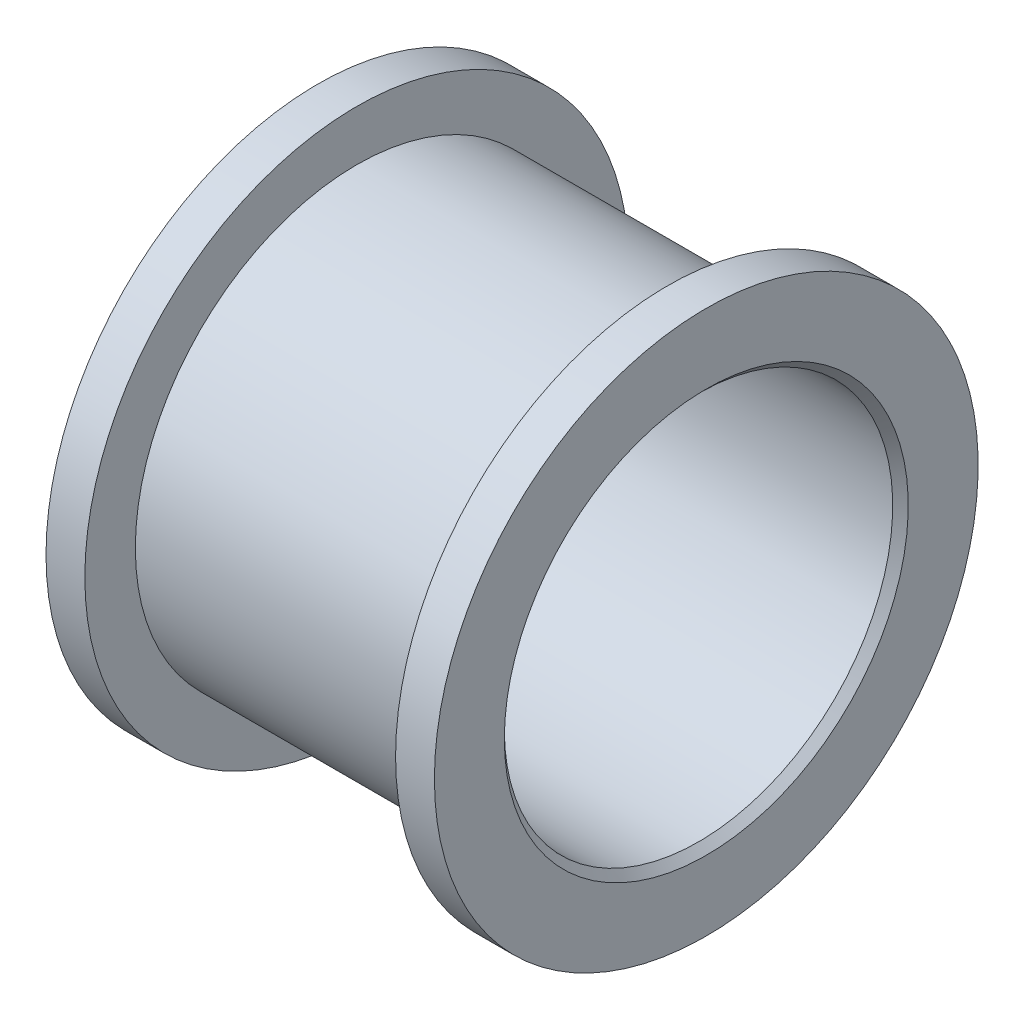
ISO-10303-21;
HEADER;
FILE_DESCRIPTION(('STEP AP214'),'2;1');
FILE_NAME('part.step','',(''),(''),'','','');
FILE_SCHEMA(('AUTOMOTIVE_DESIGN { 1 0 10303 214 1 1 1 1 }'));
ENDSEC;
DATA;
#1=APPLICATION_CONTEXT('core data for automotive mechanical design processes');
#2=APPLICATION_PROTOCOL_DEFINITION('international standard','automotive_design',2000,#1);
#3=PRODUCT_CONTEXT('',#1,'mechanical');
#4=PRODUCT('Part','Part','',(#3));
#5=PRODUCT_RELATED_PRODUCT_CATEGORY('part','',(#4));
#6=PRODUCT_DEFINITION_FORMATION('','',#4);
#7=PRODUCT_DEFINITION_CONTEXT('part definition',#1,'design');
#8=PRODUCT_DEFINITION('design','',#6,#7);
#9=PRODUCT_DEFINITION_SHAPE('','',#8);
#10=(LENGTH_UNIT() NAMED_UNIT(*) SI_UNIT(.MILLI.,.METRE.));
#11=(NAMED_UNIT(*) PLANE_ANGLE_UNIT() SI_UNIT($,.RADIAN.));
#12=(NAMED_UNIT(*) SI_UNIT($,.STERADIAN.) SOLID_ANGLE_UNIT());
#13=UNCERTAINTY_MEASURE_WITH_UNIT(LENGTH_MEASURE(1.E-05),#10,'distance_accuracy_value','');
#14=(GEOMETRIC_REPRESENTATION_CONTEXT(3) GLOBAL_UNCERTAINTY_ASSIGNED_CONTEXT((#13)) GLOBAL_UNIT_ASSIGNED_CONTEXT((#10,
#11,#12)) REPRESENTATION_CONTEXT('',''));
#15=CARTESIAN_POINT('',(0.,0.,0.));
#16=DIRECTION('',(0.,0.,1.));
#17=DIRECTION('',(1.,0.,0.));
#18=AXIS2_PLACEMENT_3D('',#15,#16,#17);
#19=CARTESIAN_POINT('',(0.,2.5,0.));
#20=DIRECTION('',(1.,0.,0.));
#21=DIRECTION('',(0.,0.,-1.));
#22=AXIS2_PLACEMENT_3D('',#19,#20,#21);
#23=PLANE('',#22);
#24=CARTESIAN_POINT('',(0.,0.,0.));
#25=DIRECTION('',(1.,0.,0.));
#26=DIRECTION('',(0.,0.,-1.));
#27=AXIS2_PLACEMENT_3D('',#24,#25,#26);
#28=CIRCLE('',#27,2.6);
#29=CARTESIAN_POINT('',(0.,0.,-2.6));
#30=VERTEX_POINT('',#29);
#31=EDGE_CURVE('E356',#30,#30,#28,.T.);
#32=ORIENTED_EDGE('',*,*,#31,.T.);
#33=EDGE_LOOP('',(#32));
#34=FACE_BOUND('',#33,.T.);
#35=CARTESIAN_POINT('',(0.,0.,0.));
#36=DIRECTION('',(-1.,0.,0.));
#37=DIRECTION('',(0.,0.,1.));
#38=AXIS2_PLACEMENT_3D('',#35,#36,#37);
#39=CIRCLE('',#38,3.5);
#40=CARTESIAN_POINT('',(0.,0.,3.5));
#41=VERTEX_POINT('',#40);
#42=EDGE_CURVE('E369',#41,#41,#39,.T.);
#43=ORIENTED_EDGE('',*,*,#42,.T.);
#44=EDGE_LOOP('',(#43));
#45=FACE_BOUND('',#44,.T.);
#46=ADVANCED_FACE('F350',(#34,#45),#23,.F.);
#47=CARTESIAN_POINT('',(-47.6496124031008,0.,0.));
#48=DIRECTION('',(-1.,0.,0.));
#49=DIRECTION('',(0.,0.,1.));
#50=AXIS2_PLACEMENT_3D('',#47,#48,#49);
#51=CYLINDRICAL_SURFACE('',#50,3.5);
#52=ORIENTED_EDGE('',*,*,#42,.F.);
#53=EDGE_LOOP('',(#52));
#54=FACE_BOUND('',#53,.T.);
#55=CARTESIAN_POINT('',(0.5,0.,0.));
#56=DIRECTION('',(-1.,0.,0.));
#57=DIRECTION('',(0.,0.,1.));
#58=AXIS2_PLACEMENT_3D('',#55,#56,#57);
#59=CIRCLE('',#58,3.5);
#60=CARTESIAN_POINT('',(0.5,0.,3.5));
#61=VERTEX_POINT('',#60);
#62=EDGE_CURVE('E372',#61,#61,#59,.T.);
#63=ORIENTED_EDGE('',*,*,#62,.T.);
#64=EDGE_LOOP('',(#63));
#65=FACE_BOUND('',#64,.T.);
#66=ADVANCED_FACE('F405',(#54,#65),#51,.T.);
#67=CARTESIAN_POINT('',(0.5,3.5,0.));
#68=DIRECTION('',(-1.,0.,0.));
#69=DIRECTION('',(0.,0.,1.));
#70=AXIS2_PLACEMENT_3D('',#67,#68,#69);
#71=PLANE('',#70);
#72=ORIENTED_EDGE('',*,*,#62,.F.);
#73=EDGE_LOOP('',(#72));
#74=FACE_BOUND('',#73,.T.);
#75=CARTESIAN_POINT('',(0.5,0.,0.));
#76=DIRECTION('',(-1.,0.,0.));
#77=DIRECTION('',(0.,0.,1.));
#78=AXIS2_PLACEMENT_3D('',#75,#76,#77);
#79=CIRCLE('',#78,2.85);
#80=CARTESIAN_POINT('',(0.5,0.,2.85));
#81=VERTEX_POINT('',#80);
#82=EDGE_CURVE('E375',#81,#81,#79,.T.);
#83=ORIENTED_EDGE('',*,*,#82,.T.);
#84=EDGE_LOOP('',(#83));
#85=FACE_BOUND('',#84,.T.);
#86=ADVANCED_FACE('F409',(#74,#85),#71,.F.);
#87=CARTESIAN_POINT('',(-47.6496124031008,0.,0.));
#88=DIRECTION('',(-1.,0.,0.));
#89=DIRECTION('',(0.,0.,1.));
#90=AXIS2_PLACEMENT_3D('',#87,#88,#89);
#91=CYLINDRICAL_SURFACE('',#90,2.85);
#92=ORIENTED_EDGE('',*,*,#82,.F.);
#93=EDGE_LOOP('',(#92));
#94=FACE_BOUND('',#93,.T.);
#95=CARTESIAN_POINT('',(4.5,0.,0.));
#96=DIRECTION('',(-1.,0.,0.));
#97=DIRECTION('',(0.,0.,1.));
#98=AXIS2_PLACEMENT_3D('',#95,#96,#97);
#99=CIRCLE('',#98,2.85);
#100=CARTESIAN_POINT('',(4.5,0.,2.85));
#101=VERTEX_POINT('',#100);
#102=EDGE_CURVE('E378',#101,#101,#99,.T.);
#103=ORIENTED_EDGE('',*,*,#102,.T.);
#104=EDGE_LOOP('',(#103));
#105=FACE_BOUND('',#104,.T.);
#106=ADVANCED_FACE('F418',(#94,#105),#91,.T.);
#107=CARTESIAN_POINT('',(4.5,2.85,0.));
#108=DIRECTION('',(1.,0.,0.));
#109=DIRECTION('',(0.,0.,-1.));
#110=AXIS2_PLACEMENT_3D('',#107,#108,#109);
#111=PLANE('',#110);
#112=ORIENTED_EDGE('',*,*,#102,.F.);
#113=EDGE_LOOP('',(#112));
#114=FACE_BOUND('',#113,.T.);
#115=CARTESIAN_POINT('',(4.5,0.,0.));
#116=DIRECTION('',(-1.,0.,0.));
#117=DIRECTION('',(0.,0.,1.));
#118=AXIS2_PLACEMENT_3D('',#115,#116,#117);
#119=CIRCLE('',#118,3.5);
#120=CARTESIAN_POINT('',(4.5,0.,3.5));
#121=VERTEX_POINT('',#120);
#122=EDGE_CURVE('E381',#121,#121,#119,.T.);
#123=ORIENTED_EDGE('',*,*,#122,.T.);
#124=EDGE_LOOP('',(#123));
#125=FACE_BOUND('',#124,.T.);
#126=ADVANCED_FACE('F402',(#114,#125),#111,.F.);
#127=CARTESIAN_POINT('',(-47.6496124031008,0.,0.));
#128=DIRECTION('',(-1.,0.,0.));
#129=DIRECTION('',(0.,0.,1.));
#130=AXIS2_PLACEMENT_3D('',#127,#128,#129);
#131=CYLINDRICAL_SURFACE('',#130,3.5);
#132=ORIENTED_EDGE('',*,*,#122,.F.);
#133=EDGE_LOOP('',(#132));
#134=FACE_BOUND('',#133,.T.);
#135=CARTESIAN_POINT('',(5.,0.,0.));
#136=DIRECTION('',(-1.,0.,0.));
#137=DIRECTION('',(0.,0.,1.));
#138=AXIS2_PLACEMENT_3D('',#135,#136,#137);
#139=CIRCLE('',#138,3.5);
#140=CARTESIAN_POINT('',(5.,0.,3.5));
#141=VERTEX_POINT('',#140);
#142=EDGE_CURVE('E384',#141,#141,#139,.T.);
#143=ORIENTED_EDGE('',*,*,#142,.T.);
#144=EDGE_LOOP('',(#143));
#145=FACE_BOUND('',#144,.T.);
#146=ADVANCED_FACE('F388',(#134,#145),#131,.T.);
#147=CARTESIAN_POINT('',(5.,2.5,0.));
#148=DIRECTION('',(-1.,0.,0.));
#149=DIRECTION('',(0.,0.,1.));
#150=AXIS2_PLACEMENT_3D('',#147,#148,#149);
#151=PLANE('',#150);
#152=CARTESIAN_POINT('',(5.,0.,0.));
#153=DIRECTION('',(-1.,0.,0.));
#154=DIRECTION('',(0.,0.,1.));
#155=AXIS2_PLACEMENT_3D('',#152,#153,#154);
#156=CIRCLE('',#155,2.6);
#157=CARTESIAN_POINT('',(5.,0.,2.6));
#158=VERTEX_POINT('',#157);
#159=EDGE_CURVE('E10',#158,#158,#156,.T.);
#160=ORIENTED_EDGE('',*,*,#159,.T.);
#161=EDGE_LOOP('',(#160));
#162=FACE_BOUND('',#161,.T.);
#163=ORIENTED_EDGE('',*,*,#142,.F.);
#164=EDGE_LOOP('',(#163));
#165=FACE_BOUND('',#164,.T.);
#166=ADVANCED_FACE('F390',(#162,#165),#151,.F.);
#167=CARTESIAN_POINT('',(-47.6496124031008,0.,0.));
#168=DIRECTION('',(-1.,0.,0.));
#169=DIRECTION('',(0.,0.,1.));
#170=AXIS2_PLACEMENT_3D('',#167,#168,#169);
#171=CYLINDRICAL_SURFACE('',#170,2.5);
#172=CARTESIAN_POINT('',(0.100000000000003,0.,0.));
#173=DIRECTION('',(1.,0.,0.));
#174=DIRECTION('',(0.,0.,-1.));
#175=AXIS2_PLACEMENT_3D('',#172,#173,#174);
#176=CIRCLE('',#175,2.5);
#177=CARTESIAN_POINT('',(0.100000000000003,0.,-2.5));
#178=VERTEX_POINT('',#177);
#179=EDGE_CURVE('E360',#178,#178,#176,.F.);
#180=ORIENTED_EDGE('',*,*,#179,.T.);
#181=EDGE_LOOP('',(#180));
#182=FACE_BOUND('',#181,.T.);
#183=CARTESIAN_POINT('',(4.9,0.,0.));
#184=DIRECTION('',(-1.,0.,0.));
#185=DIRECTION('',(0.,0.,1.));
#186=AXIS2_PLACEMENT_3D('',#183,#184,#185);
#187=CIRCLE('',#186,2.5);
#188=CARTESIAN_POINT('',(4.9,0.,2.5));
#189=VERTEX_POINT('',#188);
#190=EDGE_CURVE('E364',#189,#189,#187,.F.);
#191=ORIENTED_EDGE('',*,*,#190,.T.);
#192=EDGE_LOOP('',(#191));
#193=FACE_BOUND('',#192,.T.);
#194=ADVANCED_FACE('F392',(#182,#193),#171,.F.);
#195=CARTESIAN_POINT('',(0.100000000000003,0.,0.));
#196=DIRECTION('',(-1.,0.,0.));
#197=DIRECTION('',(0.,0.,1.));
#198=AXIS2_PLACEMENT_3D('',#195,#196,#197);
#199=CONICAL_SURFACE('',#198,2.5,0.785398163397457);
#200=ORIENTED_EDGE('',*,*,#31,.F.);
#201=EDGE_LOOP('',(#200));
#202=FACE_BOUND('',#201,.T.);
#203=ORIENTED_EDGE('',*,*,#179,.F.);
#204=EDGE_LOOP('',(#203));
#205=FACE_BOUND('',#204,.T.);
#206=ADVANCED_FACE('F398',(#202,#205),#199,.F.);
#207=CARTESIAN_POINT('',(5.,0.,0.));
#208=DIRECTION('',(1.,0.,0.));
#209=DIRECTION('',(0.,0.,-1.));
#210=AXIS2_PLACEMENT_3D('',#207,#208,#209);
#211=CONICAL_SURFACE('',#210,2.6,0.78539816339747);
#212=ORIENTED_EDGE('',*,*,#190,.F.);
#213=EDGE_LOOP('',(#212));
#214=FACE_BOUND('',#213,.T.);
#215=ORIENTED_EDGE('',*,*,#159,.F.);
#216=EDGE_LOOP('',(#215));
#217=FACE_BOUND('',#216,.T.);
#218=ADVANCED_FACE('F452',(#214,#217),#211,.F.);
#219=CLOSED_SHELL('',(#46,#66,#86,#106,#126,#146,#166,#194,#206,#218));
#220=MANIFOLD_SOLID_BREP('B2',#219);
#221=ADVANCED_BREP_SHAPE_REPRESENTATION('',(#18,#220),#14);
#222=SHAPE_DEFINITION_REPRESENTATION(#9,#221);
ENDSEC;
END-ISO-10303-21;
